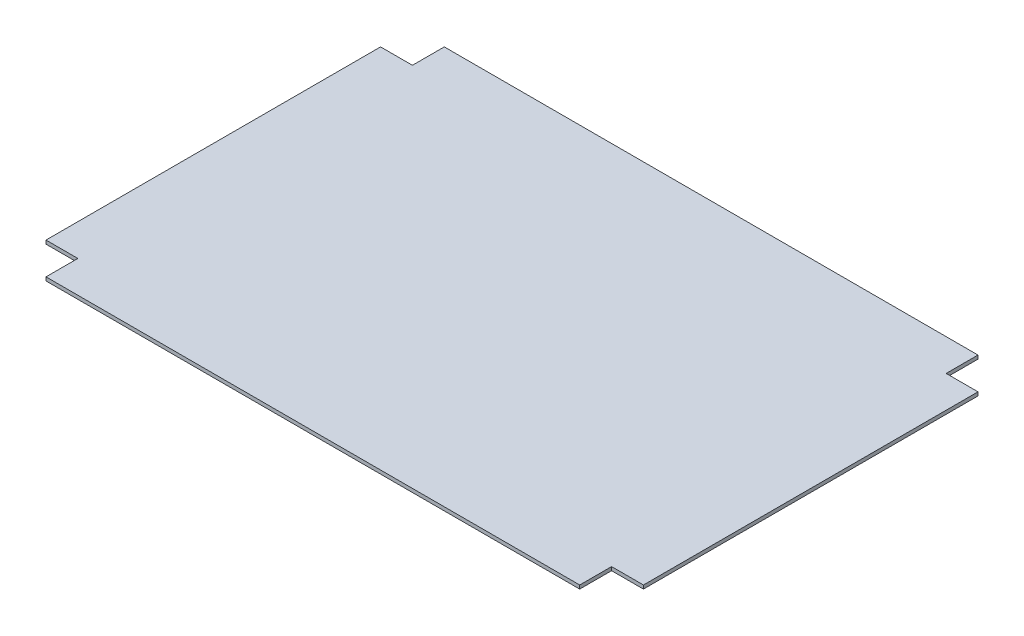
ISO-10303-21;
HEADER;
FILE_DESCRIPTION(('STEP AP214'),'2;1');
FILE_NAME('part.step','',(''),(''),'','','');
FILE_SCHEMA(('AUTOMOTIVE_DESIGN { 1 0 10303 214 1 1 1 1 }'));
ENDSEC;
DATA;
#1=APPLICATION_CONTEXT('core data for automotive mechanical design processes');
#2=APPLICATION_PROTOCOL_DEFINITION('international standard','automotive_design',2000,#1);
#3=PRODUCT_CONTEXT('',#1,'mechanical');
#4=PRODUCT('Part','Part','',(#3));
#5=PRODUCT_RELATED_PRODUCT_CATEGORY('part','',(#4));
#6=PRODUCT_DEFINITION_FORMATION('','',#4);
#7=PRODUCT_DEFINITION_CONTEXT('part definition',#1,'design');
#8=PRODUCT_DEFINITION('design','',#6,#7);
#9=PRODUCT_DEFINITION_SHAPE('','',#8);
#10=(LENGTH_UNIT() NAMED_UNIT(*) SI_UNIT(.MILLI.,.METRE.));
#11=(NAMED_UNIT(*) PLANE_ANGLE_UNIT() SI_UNIT($,.RADIAN.));
#12=(NAMED_UNIT(*) SI_UNIT($,.STERADIAN.) SOLID_ANGLE_UNIT());
#13=UNCERTAINTY_MEASURE_WITH_UNIT(LENGTH_MEASURE(1.E-05),#10,'distance_accuracy_value','');
#14=(GEOMETRIC_REPRESENTATION_CONTEXT(3) GLOBAL_UNCERTAINTY_ASSIGNED_CONTEXT((#13)) GLOBAL_UNIT_ASSIGNED_CONTEXT((#10,
#11,#12)) REPRESENTATION_CONTEXT('',''));
#15=CARTESIAN_POINT('',(0.,0.,0.));
#16=DIRECTION('',(0.,0.,1.));
#17=DIRECTION('',(1.,0.,0.));
#18=AXIS2_PLACEMENT_3D('',#15,#16,#17);
#19=CARTESIAN_POINT('',(-3.15719672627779E-13,9.,-455.));
#20=DIRECTION('',(0.,0.,-1.));
#21=DIRECTION('',(-1.,0.,0.));
#22=AXIS2_PLACEMENT_3D('',#19,#20,#21);
#23=PLANE('',#22);
#24=DIRECTION('',(1.,0.,0.));
#25=VECTOR('',#24,1.);
#26=CARTESIAN_POINT('',(-3.15719672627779E-13,0.,-455.));
#27=LINE('',#26,#25);
#28=CARTESIAN_POINT('',(670.,0.,-455.));
#29=VERTEX_POINT('',#28);
#30=CARTESIAN_POINT('',(750.,0.,-455.));
#31=VERTEX_POINT('',#30);
#32=EDGE_CURVE('E168',#29,#31,#27,.T.);
#33=ORIENTED_EDGE('',*,*,#32,.F.);
#34=DIRECTION('',(0.,-1.,0.));
#35=VECTOR('',#34,1.);
#36=CARTESIAN_POINT('',(670.,9.,-455.));
#37=LINE('',#36,#35);
#38=CARTESIAN_POINT('',(670.,9.,-455.));
#39=VERTEX_POINT('',#38);
#40=EDGE_CURVE('E11',#39,#29,#37,.T.);
#41=ORIENTED_EDGE('',*,*,#40,.F.);
#42=DIRECTION('',(1.,0.,0.));
#43=VECTOR('',#42,1.);
#44=CARTESIAN_POINT('',(-3.15719672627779E-13,9.,-455.));
#45=LINE('',#44,#43);
#46=CARTESIAN_POINT('',(750.,9.,-455.));
#47=VERTEX_POINT('',#46);
#48=EDGE_CURVE('E208',#39,#47,#45,.T.);
#49=ORIENTED_EDGE('',*,*,#48,.T.);
#50=DIRECTION('',(0.,-1.,0.));
#51=VECTOR('',#50,1.);
#52=CARTESIAN_POINT('',(750.,9.,-455.));
#53=LINE('',#52,#51);
#54=EDGE_CURVE('E111',#47,#31,#53,.T.);
#55=ORIENTED_EDGE('',*,*,#54,.T.);
#56=EDGE_LOOP('',(#33,#41,#49,#55));
#57=FACE_BOUND('',#56,.T.);
#58=ADVANCED_FACE('F47',(#57),#23,.T.);
#59=CARTESIAN_POINT('',(670.,9.,0.));
#60=DIRECTION('',(1.,0.,0.));
#61=DIRECTION('',(0.,0.,-1.));
#62=AXIS2_PLACEMENT_3D('',#59,#60,#61);
#63=PLANE('',#62);
#64=DIRECTION('',(0.,0.,1.));
#65=VECTOR('',#64,1.);
#66=CARTESIAN_POINT('',(670.,0.,0.));
#67=LINE('',#66,#65);
#68=CARTESIAN_POINT('',(670.,0.,-535.));
#69=VERTEX_POINT('',#68);
#70=EDGE_CURVE('E172',#69,#29,#67,.T.);
#71=ORIENTED_EDGE('',*,*,#70,.F.);
#72=DIRECTION('',(0.,-1.,0.));
#73=VECTOR('',#72,1.);
#74=CARTESIAN_POINT('',(670.,9.,-535.));
#75=LINE('',#74,#73);
#76=CARTESIAN_POINT('',(670.,9.,-535.));
#77=VERTEX_POINT('',#76);
#78=EDGE_CURVE('E56',#77,#69,#75,.T.);
#79=ORIENTED_EDGE('',*,*,#78,.F.);
#80=DIRECTION('',(0.,0.,1.));
#81=VECTOR('',#80,1.);
#82=CARTESIAN_POINT('',(670.,9.,0.));
#83=LINE('',#82,#81);
#84=EDGE_CURVE('E256',#77,#39,#83,.T.);
#85=ORIENTED_EDGE('',*,*,#84,.T.);
#86=ORIENTED_EDGE('',*,*,#40,.T.);
#87=EDGE_LOOP('',(#71,#79,#85,#86));
#88=FACE_BOUND('',#87,.T.);
#89=ADVANCED_FACE('F245',(#88),#63,.T.);
#90=CARTESIAN_POINT('',(0.,9.,-535.));
#91=DIRECTION('',(0.,0.,-1.));
#92=DIRECTION('',(-1.,0.,0.));
#93=AXIS2_PLACEMENT_3D('',#90,#91,#92);
#94=PLANE('',#93);
#95=DIRECTION('',(1.,0.,0.));
#96=VECTOR('',#95,1.);
#97=CARTESIAN_POINT('',(0.,0.,-535.));
#98=LINE('',#97,#96);
#99=CARTESIAN_POINT('',(-670.,0.,-535.));
#100=VERTEX_POINT('',#99);
#101=EDGE_CURVE('E176',#100,#69,#98,.T.);
#102=ORIENTED_EDGE('',*,*,#101,.F.);
#103=DIRECTION('',(0.,-1.,0.));
#104=VECTOR('',#103,1.);
#105=CARTESIAN_POINT('',(-670.,9.,-535.));
#106=LINE('',#105,#104);
#107=CARTESIAN_POINT('',(-670.,9.,-535.));
#108=VERTEX_POINT('',#107);
#109=EDGE_CURVE('E232',#108,#100,#106,.T.);
#110=ORIENTED_EDGE('',*,*,#109,.F.);
#111=DIRECTION('',(1.,0.,0.));
#112=VECTOR('',#111,1.);
#113=CARTESIAN_POINT('',(0.,9.,-535.));
#114=LINE('',#113,#112);
#115=EDGE_CURVE('E241',#108,#77,#114,.T.);
#116=ORIENTED_EDGE('',*,*,#115,.T.);
#117=ORIENTED_EDGE('',*,*,#78,.T.);
#118=EDGE_LOOP('',(#102,#110,#116,#117));
#119=FACE_BOUND('',#118,.T.);
#120=ADVANCED_FACE('F239',(#119),#94,.T.);
#121=CARTESIAN_POINT('',(-670.,9.,0.));
#122=DIRECTION('',(-1.,0.,0.));
#123=DIRECTION('',(0.,0.,1.));
#124=AXIS2_PLACEMENT_3D('',#121,#122,#123);
#125=PLANE('',#124);
#126=DIRECTION('',(0.,0.,-1.));
#127=VECTOR('',#126,1.);
#128=CARTESIAN_POINT('',(-670.,0.,0.));
#129=LINE('',#128,#127);
#130=CARTESIAN_POINT('',(-670.,0.,-455.));
#131=VERTEX_POINT('',#130);
#132=EDGE_CURVE('E180',#131,#100,#129,.T.);
#133=ORIENTED_EDGE('',*,*,#132,.F.);
#134=DIRECTION('',(0.,-1.,0.));
#135=VECTOR('',#134,1.);
#136=CARTESIAN_POINT('',(-670.,9.,-455.));
#137=LINE('',#136,#135);
#138=CARTESIAN_POINT('',(-670.,9.,-455.));
#139=VERTEX_POINT('',#138);
#140=EDGE_CURVE('E229',#139,#131,#137,.T.);
#141=ORIENTED_EDGE('',*,*,#140,.F.);
#142=DIRECTION('',(0.,0.,-1.));
#143=VECTOR('',#142,1.);
#144=CARTESIAN_POINT('',(-670.,9.,0.));
#145=LINE('',#144,#143);
#146=EDGE_CURVE('E255',#139,#108,#145,.T.);
#147=ORIENTED_EDGE('',*,*,#146,.T.);
#148=ORIENTED_EDGE('',*,*,#109,.T.);
#149=EDGE_LOOP('',(#133,#141,#147,#148));
#150=FACE_BOUND('',#149,.T.);
#151=ADVANCED_FACE('F251',(#150),#125,.T.);
#152=CARTESIAN_POINT('',(-3.15719672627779E-13,9.,-455.));
#153=DIRECTION('',(0.,0.,1.));
#154=DIRECTION('',(1.,0.,0.));
#155=AXIS2_PLACEMENT_3D('',#152,#153,#154);
#156=PLANE('',#155);
#157=DIRECTION('',(-1.,0.,0.));
#158=VECTOR('',#157,1.);
#159=CARTESIAN_POINT('',(-3.15719672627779E-13,0.,-455.));
#160=LINE('',#159,#158);
#161=CARTESIAN_POINT('',(-750.,0.,-455.));
#162=VERTEX_POINT('',#161);
#163=EDGE_CURVE('E184',#131,#162,#160,.T.);
#164=ORIENTED_EDGE('',*,*,#163,.T.);
#165=DIRECTION('',(0.,-1.,0.));
#166=VECTOR('',#165,1.);
#167=CARTESIAN_POINT('',(-750.,9.,-455.));
#168=LINE('',#167,#166);
#169=CARTESIAN_POINT('',(-750.,9.,-455.));
#170=VERTEX_POINT('',#169);
#171=EDGE_CURVE('E226',#170,#162,#168,.T.);
#172=ORIENTED_EDGE('',*,*,#171,.F.);
#173=DIRECTION('',(-1.,0.,0.));
#174=VECTOR('',#173,1.);
#175=CARTESIAN_POINT('',(-3.15719672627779E-13,9.,-455.));
#176=LINE('',#175,#174);
#177=EDGE_CURVE('E261',#139,#170,#176,.T.);
#178=ORIENTED_EDGE('',*,*,#177,.F.);
#179=ORIENTED_EDGE('',*,*,#140,.T.);
#180=EDGE_LOOP('',(#164,#172,#178,#179));
#181=FACE_BOUND('',#180,.T.);
#182=ADVANCED_FACE('F304',(#181),#156,.F.);
#183=CARTESIAN_POINT('',(-750.,9.,1.81014623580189E-13));
#184=DIRECTION('',(-1.,0.,0.));
#185=DIRECTION('',(0.,0.,1.));
#186=AXIS2_PLACEMENT_3D('',#183,#184,#185);
#187=PLANE('',#186);
#188=DIRECTION('',(0.,0.,-1.));
#189=VECTOR('',#188,1.);
#190=CARTESIAN_POINT('',(-750.,0.,1.81014623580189E-13));
#191=LINE('',#190,#189);
#192=CARTESIAN_POINT('',(-750.,0.,385.));
#193=VERTEX_POINT('',#192);
#194=EDGE_CURVE('E188',#193,#162,#191,.T.);
#195=ORIENTED_EDGE('',*,*,#194,.F.);
#196=DIRECTION('',(0.,-1.,0.));
#197=VECTOR('',#196,1.);
#198=CARTESIAN_POINT('',(-750.,9.,385.));
#199=LINE('',#198,#197);
#200=CARTESIAN_POINT('',(-750.,9.,385.));
#201=VERTEX_POINT('',#200);
#202=EDGE_CURVE('E223',#201,#193,#199,.T.);
#203=ORIENTED_EDGE('',*,*,#202,.F.);
#204=DIRECTION('',(0.,0.,-1.));
#205=VECTOR('',#204,1.);
#206=CARTESIAN_POINT('',(-750.,9.,1.81014623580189E-13));
#207=LINE('',#206,#205);
#208=EDGE_CURVE('E268',#201,#170,#207,.T.);
#209=ORIENTED_EDGE('',*,*,#208,.T.);
#210=ORIENTED_EDGE('',*,*,#171,.T.);
#211=EDGE_LOOP('',(#195,#203,#209,#210));
#212=FACE_BOUND('',#211,.T.);
#213=ADVANCED_FACE('F307',(#212),#187,.T.);
#214=CARTESIAN_POINT('',(0.,9.,385.));
#215=DIRECTION('',(0.,0.,-1.));
#216=DIRECTION('',(-1.,0.,0.));
#217=AXIS2_PLACEMENT_3D('',#214,#215,#216);
#218=PLANE('',#217);
#219=DIRECTION('',(1.,0.,0.));
#220=VECTOR('',#219,1.);
#221=CARTESIAN_POINT('',(0.,0.,385.));
#222=LINE('',#221,#220);
#223=CARTESIAN_POINT('',(-670.,0.,385.));
#224=VERTEX_POINT('',#223);
#225=EDGE_CURVE('E192',#193,#224,#222,.T.);
#226=ORIENTED_EDGE('',*,*,#225,.T.);
#227=DIRECTION('',(0.,-1.,0.));
#228=VECTOR('',#227,1.);
#229=CARTESIAN_POINT('',(-670.,9.,385.));
#230=LINE('',#229,#228);
#231=CARTESIAN_POINT('',(-670.,9.,385.));
#232=VERTEX_POINT('',#231);
#233=EDGE_CURVE('E219',#232,#224,#230,.T.);
#234=ORIENTED_EDGE('',*,*,#233,.F.);
#235=DIRECTION('',(1.,0.,0.));
#236=VECTOR('',#235,1.);
#237=CARTESIAN_POINT('',(0.,9.,385.));
#238=LINE('',#237,#236);
#239=EDGE_CURVE('E272',#201,#232,#238,.T.);
#240=ORIENTED_EDGE('',*,*,#239,.F.);
#241=ORIENTED_EDGE('',*,*,#202,.T.);
#242=EDGE_LOOP('',(#226,#234,#240,#241));
#243=FACE_BOUND('',#242,.T.);
#244=ADVANCED_FACE('F311',(#243),#218,.F.);
#245=CARTESIAN_POINT('',(-670.,9.,0.));
#246=DIRECTION('',(1.,0.,0.));
#247=DIRECTION('',(0.,0.,-1.));
#248=AXIS2_PLACEMENT_3D('',#245,#246,#247);
#249=PLANE('',#248);
#250=DIRECTION('',(0.,0.,1.));
#251=VECTOR('',#250,1.);
#252=CARTESIAN_POINT('',(-670.,0.,0.));
#253=LINE('',#252,#251);
#254=CARTESIAN_POINT('',(-670.,0.,465.));
#255=VERTEX_POINT('',#254);
#256=EDGE_CURVE('E195',#224,#255,#253,.T.);
#257=ORIENTED_EDGE('',*,*,#256,.T.);
#258=DIRECTION('',(0.,-1.,0.));
#259=VECTOR('',#258,1.);
#260=CARTESIAN_POINT('',(-670.,9.,465.));
#261=LINE('',#260,#259);
#262=CARTESIAN_POINT('',(-670.,9.,465.));
#263=VERTEX_POINT('',#262);
#264=EDGE_CURVE('E215',#263,#255,#261,.T.);
#265=ORIENTED_EDGE('',*,*,#264,.F.);
#266=DIRECTION('',(0.,0.,1.));
#267=VECTOR('',#266,1.);
#268=CARTESIAN_POINT('',(-670.,9.,0.));
#269=LINE('',#268,#267);
#270=EDGE_CURVE('E275',#232,#263,#269,.T.);
#271=ORIENTED_EDGE('',*,*,#270,.F.);
#272=ORIENTED_EDGE('',*,*,#233,.T.);
#273=EDGE_LOOP('',(#257,#265,#271,#272));
#274=FACE_BOUND('',#273,.T.);
#275=ADVANCED_FACE('F284',(#274),#249,.F.);
#276=CARTESIAN_POINT('',(0.,9.,465.));
#277=DIRECTION('',(0.,0.,-1.));
#278=DIRECTION('',(-1.,0.,0.));
#279=AXIS2_PLACEMENT_3D('',#276,#277,#278);
#280=PLANE('',#279);
#281=DIRECTION('',(1.,0.,0.));
#282=VECTOR('',#281,1.);
#283=CARTESIAN_POINT('',(0.,0.,465.));
#284=LINE('',#283,#282);
#285=CARTESIAN_POINT('',(670.,0.,465.));
#286=VERTEX_POINT('',#285);
#287=EDGE_CURVE('E198',#255,#286,#284,.T.);
#288=ORIENTED_EDGE('',*,*,#287,.T.);
#289=DIRECTION('',(0.,-1.,0.));
#290=VECTOR('',#289,1.);
#291=CARTESIAN_POINT('',(670.,9.,465.));
#292=LINE('',#291,#290);
#293=CARTESIAN_POINT('',(670.,9.,465.));
#294=VERTEX_POINT('',#293);
#295=EDGE_CURVE('E158',#294,#286,#292,.T.);
#296=ORIENTED_EDGE('',*,*,#295,.F.);
#297=DIRECTION('',(1.,0.,0.));
#298=VECTOR('',#297,1.);
#299=CARTESIAN_POINT('',(0.,9.,465.));
#300=LINE('',#299,#298);
#301=EDGE_CURVE('E147',#263,#294,#300,.T.);
#302=ORIENTED_EDGE('',*,*,#301,.F.);
#303=ORIENTED_EDGE('',*,*,#264,.T.);
#304=EDGE_LOOP('',(#288,#296,#302,#303));
#305=FACE_BOUND('',#304,.T.);
#306=ADVANCED_FACE('F288',(#305),#280,.F.);
#307=CARTESIAN_POINT('',(670.,9.,0.));
#308=DIRECTION('',(-1.,0.,0.));
#309=DIRECTION('',(0.,0.,1.));
#310=AXIS2_PLACEMENT_3D('',#307,#308,#309);
#311=PLANE('',#310);
#312=DIRECTION('',(0.,0.,-1.));
#313=VECTOR('',#312,1.);
#314=CARTESIAN_POINT('',(670.,0.,0.));
#315=LINE('',#314,#313);
#316=CARTESIAN_POINT('',(670.,0.,385.));
#317=VERTEX_POINT('',#316);
#318=EDGE_CURVE('E156',#286,#317,#315,.T.);
#319=ORIENTED_EDGE('',*,*,#318,.T.);
#320=DIRECTION('',(0.,-1.,0.));
#321=VECTOR('',#320,1.);
#322=CARTESIAN_POINT('',(670.,9.,385.));
#323=LINE('',#322,#321);
#324=CARTESIAN_POINT('',(670.,9.,385.));
#325=VERTEX_POINT('',#324);
#326=EDGE_CURVE('E153',#325,#317,#323,.T.);
#327=ORIENTED_EDGE('',*,*,#326,.F.);
#328=DIRECTION('',(0.,0.,-1.));
#329=VECTOR('',#328,1.);
#330=CARTESIAN_POINT('',(670.,9.,0.));
#331=LINE('',#330,#329);
#332=EDGE_CURVE('E141',#294,#325,#331,.T.);
#333=ORIENTED_EDGE('',*,*,#332,.F.);
#334=ORIENTED_EDGE('',*,*,#295,.T.);
#335=EDGE_LOOP('',(#319,#327,#333,#334));
#336=FACE_BOUND('',#335,.T.);
#337=ADVANCED_FACE('F154',(#336),#311,.F.);
#338=CARTESIAN_POINT('',(2.67147415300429E-13,9.,385.));
#339=DIRECTION('',(0.,0.,-1.));
#340=DIRECTION('',(-1.,0.,0.));
#341=AXIS2_PLACEMENT_3D('',#338,#339,#340);
#342=PLANE('',#341);
#343=DIRECTION('',(1.,0.,0.));
#344=VECTOR('',#343,1.);
#345=CARTESIAN_POINT('',(2.67147415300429E-13,0.,385.));
#346=LINE('',#345,#344);
#347=CARTESIAN_POINT('',(750.,0.,385.));
#348=VERTEX_POINT('',#347);
#349=EDGE_CURVE('E104',#317,#348,#346,.T.);
#350=ORIENTED_EDGE('',*,*,#349,.T.);
#351=DIRECTION('',(0.,-1.,0.));
#352=VECTOR('',#351,1.);
#353=CARTESIAN_POINT('',(750.,9.,385.));
#354=LINE('',#353,#352);
#355=CARTESIAN_POINT('',(750.,9.,385.));
#356=VERTEX_POINT('',#355);
#357=EDGE_CURVE('E159',#356,#348,#354,.T.);
#358=ORIENTED_EDGE('',*,*,#357,.F.);
#359=DIRECTION('',(1.,0.,0.));
#360=VECTOR('',#359,1.);
#361=CARTESIAN_POINT('',(2.67147415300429E-13,9.,385.));
#362=LINE('',#361,#360);
#363=EDGE_CURVE('E145',#325,#356,#362,.T.);
#364=ORIENTED_EDGE('',*,*,#363,.F.);
#365=ORIENTED_EDGE('',*,*,#326,.T.);
#366=EDGE_LOOP('',(#350,#358,#364,#365));
#367=FACE_BOUND('',#366,.T.);
#368=ADVANCED_FACE('F161',(#367),#342,.F.);
#369=CARTESIAN_POINT('',(750.,9.,0.));
#370=DIRECTION('',(-1.,0.,0.));
#371=DIRECTION('',(0.,0.,1.));
#372=AXIS2_PLACEMENT_3D('',#369,#370,#371);
#373=PLANE('',#372);
#374=DIRECTION('',(0.,0.,-1.));
#375=VECTOR('',#374,1.);
#376=CARTESIAN_POINT('',(750.,0.,0.));
#377=LINE('',#376,#375);
#378=EDGE_CURVE('E205',#348,#31,#377,.T.);
#379=ORIENTED_EDGE('',*,*,#378,.T.);
#380=ORIENTED_EDGE('',*,*,#54,.F.);
#381=DIRECTION('',(0.,0.,-1.));
#382=VECTOR('',#381,1.);
#383=CARTESIAN_POINT('',(750.,9.,0.));
#384=LINE('',#383,#382);
#385=EDGE_CURVE('E64',#356,#47,#384,.T.);
#386=ORIENTED_EDGE('',*,*,#385,.F.);
#387=ORIENTED_EDGE('',*,*,#357,.T.);
#388=EDGE_LOOP('',(#379,#380,#386,#387));
#389=FACE_BOUND('',#388,.T.);
#390=ADVANCED_FACE('F291',(#389),#373,.F.);
#391=CARTESIAN_POINT('',(0.,9.,0.));
#392=DIRECTION('',(0.,1.,0.));
#393=DIRECTION('',(0.,0.,1.));
#394=AXIS2_PLACEMENT_3D('',#391,#392,#393);
#395=PLANE('',#394);
#396=ORIENTED_EDGE('',*,*,#48,.F.);
#397=ORIENTED_EDGE('',*,*,#84,.F.);
#398=ORIENTED_EDGE('',*,*,#115,.F.);
#399=ORIENTED_EDGE('',*,*,#146,.F.);
#400=ORIENTED_EDGE('',*,*,#177,.T.);
#401=ORIENTED_EDGE('',*,*,#208,.F.);
#402=ORIENTED_EDGE('',*,*,#239,.T.);
#403=ORIENTED_EDGE('',*,*,#270,.T.);
#404=ORIENTED_EDGE('',*,*,#301,.T.);
#405=ORIENTED_EDGE('',*,*,#332,.T.);
#406=ORIENTED_EDGE('',*,*,#363,.T.);
#407=ORIENTED_EDGE('',*,*,#385,.T.);
#408=EDGE_LOOP('',(#396,#397,#398,#399,#400,#401,#402,#403,#404,#405,#406,#407));
#409=FACE_BOUND('',#408,.T.);
#410=ADVANCED_FACE('F143',(#409),#395,.T.);
#411=CARTESIAN_POINT('',(0.,0.,0.));
#412=DIRECTION('',(0.,1.,0.));
#413=DIRECTION('',(0.,0.,1.));
#414=AXIS2_PLACEMENT_3D('',#411,#412,#413);
#415=PLANE('',#414);
#416=ORIENTED_EDGE('',*,*,#32,.T.);
#417=ORIENTED_EDGE('',*,*,#378,.F.);
#418=ORIENTED_EDGE('',*,*,#349,.F.);
#419=ORIENTED_EDGE('',*,*,#318,.F.);
#420=ORIENTED_EDGE('',*,*,#287,.F.);
#421=ORIENTED_EDGE('',*,*,#256,.F.);
#422=ORIENTED_EDGE('',*,*,#225,.F.);
#423=ORIENTED_EDGE('',*,*,#194,.T.);
#424=ORIENTED_EDGE('',*,*,#163,.F.);
#425=ORIENTED_EDGE('',*,*,#132,.T.);
#426=ORIENTED_EDGE('',*,*,#101,.T.);
#427=ORIENTED_EDGE('',*,*,#70,.T.);
#428=EDGE_LOOP('',(#416,#417,#418,#419,#420,#421,#422,#423,#424,#425,#426,#427));
#429=FACE_BOUND('',#428,.T.);
#430=ADVANCED_FACE('F247',(#429),#415,.F.);
#431=CLOSED_SHELL('',(#58,#89,#120,#151,#182,#213,#244,#275,#306,#337,#368,#390,#410,#430));
#432=MANIFOLD_SOLID_BREP('B2',#431);
#433=ADVANCED_BREP_SHAPE_REPRESENTATION('',(#18,#432),#14);
#434=SHAPE_DEFINITION_REPRESENTATION(#9,#433);
ENDSEC;
END-ISO-10303-21;
